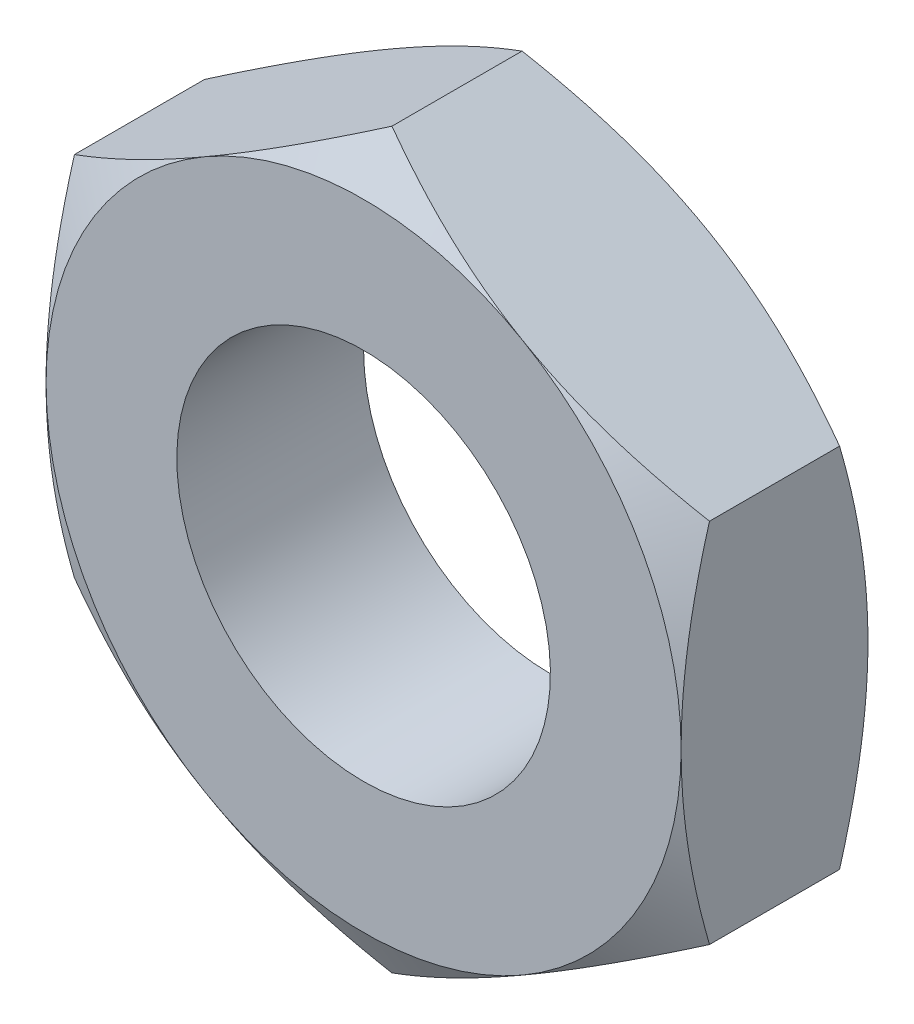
ISO-10303-21;
HEADER;
FILE_DESCRIPTION(('STEP AP214'),'2;1');
FILE_NAME('part.step','',(''),(''),'','','');
FILE_SCHEMA(('AUTOMOTIVE_DESIGN { 1 0 10303 214 1 1 1 1 }'));
ENDSEC;
DATA;
#1=APPLICATION_CONTEXT('core data for automotive mechanical design processes');
#2=APPLICATION_PROTOCOL_DEFINITION('international standard','automotive_design',2000,#1);
#3=PRODUCT_CONTEXT('',#1,'mechanical');
#4=PRODUCT('Part','Part','',(#3));
#5=PRODUCT_RELATED_PRODUCT_CATEGORY('part','',(#4));
#6=PRODUCT_DEFINITION_FORMATION('','',#4);
#7=PRODUCT_DEFINITION_CONTEXT('part definition',#1,'design');
#8=PRODUCT_DEFINITION('design','',#6,#7);
#9=PRODUCT_DEFINITION_SHAPE('','',#8);
#10=(LENGTH_UNIT() NAMED_UNIT(*) SI_UNIT(.MILLI.,.METRE.));
#11=(NAMED_UNIT(*) PLANE_ANGLE_UNIT() SI_UNIT($,.RADIAN.));
#12=(NAMED_UNIT(*) SI_UNIT($,.STERADIAN.) SOLID_ANGLE_UNIT());
#13=UNCERTAINTY_MEASURE_WITH_UNIT(LENGTH_MEASURE(1.E-05),#10,'distance_accuracy_value','');
#14=(GEOMETRIC_REPRESENTATION_CONTEXT(3) GLOBAL_UNCERTAINTY_ASSIGNED_CONTEXT((#13)) GLOBAL_UNIT_ASSIGNED_CONTEXT((#10,
#11,#12)) REPRESENTATION_CONTEXT('',''));
#15=CARTESIAN_POINT('',(0.,0.,0.));
#16=DIRECTION('',(0.,0.,1.));
#17=DIRECTION('',(1.,0.,0.));
#18=AXIS2_PLACEMENT_3D('',#15,#16,#17);
#19=CARTESIAN_POINT('',(5.,0.,0.));
#20=DIRECTION('',(0.,0.,-1.));
#21=DIRECTION('',(0.,1.,0.));
#22=AXIS2_PLACEMENT_3D('',#19,#20,#21);
#23=PLANE('',#22);
#24=CARTESIAN_POINT('',(0.,0.,0.));
#25=DIRECTION('',(0.,0.,-1.));
#26=DIRECTION('',(0.,1.,0.));
#27=AXIS2_PLACEMENT_3D('',#24,#25,#26);
#28=CIRCLE('',#27,5.);
#29=CARTESIAN_POINT('',(0.,5.,0.));
#30=VERTEX_POINT('',#29);
#31=EDGE_CURVE('E109',#30,#30,#28,.T.);
#32=ORIENTED_EDGE('',*,*,#31,.F.);
#33=EDGE_LOOP('',(#32));
#34=FACE_BOUND('',#33,.T.);
#35=CARTESIAN_POINT('',(0.,0.,0.));
#36=DIRECTION('',(0.,0.,1.));
#37=DIRECTION('',(0.,-1.,0.));
#38=AXIS2_PLACEMENT_3D('',#35,#36,#37);
#39=CIRCLE('',#38,8.5);
#40=CARTESIAN_POINT('',(-4.25,7.36121593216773,0.));
#41=VERTEX_POINT('',#40);
#42=CARTESIAN_POINT('',(-8.5,0.,0.));
#43=VERTEX_POINT('',#42);
#44=EDGE_CURVE('E415',#41,#43,#39,.T.);
#45=ORIENTED_EDGE('',*,*,#44,.F.);
#46=CARTESIAN_POINT('',(0.,0.,0.));
#47=DIRECTION('',(0.,0.,1.));
#48=DIRECTION('',(0.,-1.,0.));
#49=AXIS2_PLACEMENT_3D('',#46,#47,#48);
#50=CIRCLE('',#49,8.5);
#51=CARTESIAN_POINT('',(4.25,7.36121593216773,0.));
#52=VERTEX_POINT('',#51);
#53=EDGE_CURVE('E104',#52,#41,#50,.T.);
#54=ORIENTED_EDGE('',*,*,#53,.F.);
#55=CARTESIAN_POINT('',(0.,0.,0.));
#56=DIRECTION('',(0.,0.,1.));
#57=DIRECTION('',(0.,-1.,0.));
#58=AXIS2_PLACEMENT_3D('',#55,#56,#57);
#59=CIRCLE('',#58,8.5);
#60=CARTESIAN_POINT('',(8.5,0.,0.));
#61=VERTEX_POINT('',#60);
#62=EDGE_CURVE('E17',#61,#52,#59,.T.);
#63=ORIENTED_EDGE('',*,*,#62,.F.);
#64=CARTESIAN_POINT('',(0.,0.,0.));
#65=DIRECTION('',(0.,0.,1.));
#66=DIRECTION('',(0.,-1.,0.));
#67=AXIS2_PLACEMENT_3D('',#64,#65,#66);
#68=CIRCLE('',#67,8.5);
#69=CARTESIAN_POINT('',(4.25,-7.36121593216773,0.));
#70=VERTEX_POINT('',#69);
#71=EDGE_CURVE('E101',#70,#61,#68,.T.);
#72=ORIENTED_EDGE('',*,*,#71,.F.);
#73=CARTESIAN_POINT('',(0.,0.,0.));
#74=DIRECTION('',(0.,0.,1.));
#75=DIRECTION('',(0.,-1.,0.));
#76=AXIS2_PLACEMENT_3D('',#73,#74,#75);
#77=CIRCLE('',#76,8.5);
#78=CARTESIAN_POINT('',(-4.25,-7.36121593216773,0.));
#79=VERTEX_POINT('',#78);
#80=EDGE_CURVE('E119',#79,#70,#77,.T.);
#81=ORIENTED_EDGE('',*,*,#80,.F.);
#82=CARTESIAN_POINT('',(0.,0.,0.));
#83=DIRECTION('',(0.,0.,1.));
#84=DIRECTION('',(0.,-1.,0.));
#85=AXIS2_PLACEMENT_3D('',#82,#83,#84);
#86=CIRCLE('',#85,8.5);
#87=EDGE_CURVE('E417',#43,#79,#86,.T.);
#88=ORIENTED_EDGE('',*,*,#87,.F.);
#89=EDGE_LOOP('',(#45,#54,#63,#72,#81,#88));
#90=FACE_BOUND('',#89,.T.);
#91=ADVANCED_FACE('F14',(#34,#90),#23,.T.);
#92=CARTESIAN_POINT('',(0.,0.,0.763744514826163));
#93=DIRECTION('',(0.,0.,1.));
#94=DIRECTION('',(0.,-1.,0.));
#95=AXIS2_PLACEMENT_3D('',#92,#93,#94);
#96=CONICAL_SURFACE('',#95,9.82284430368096,1.0471975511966);
#97=CARTESIAN_POINT('',(8.5,4.90747728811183,0.759189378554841));
#98=CARTESIAN_POINT('',(8.15405181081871,5.1072105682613,0.643844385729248));
#99=CARTESIAN_POINT('',(7.8053331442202,5.3085433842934,0.538168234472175));
#100=CARTESIAN_POINT('',(7.10482189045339,5.71298374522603,0.351810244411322));
#101=CARTESIAN_POINT('',(6.75305373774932,5.91607718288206,0.27100481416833));
#102=CARTESIAN_POINT('',(6.22208167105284,6.22263404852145,0.171789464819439));
#103=CARTESIAN_POINT('',(6.04442025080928,6.32520691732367,0.142371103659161));
#104=CARTESIAN_POINT('',(5.6882468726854,6.53084371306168,0.0914473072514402));
#105=CARTESIAN_POINT('',(5.50973493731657,6.63390762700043,0.0699416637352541));
#106=CARTESIAN_POINT('',(5.15120023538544,6.84090773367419,0.0352211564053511));
#107=CARTESIAN_POINT('',(4.97117438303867,6.94484570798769,0.0220484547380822));
#108=CARTESIAN_POINT('',(4.61076862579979,7.15292606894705,0.00441964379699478));
#109=CARTESIAN_POINT('',(4.43038865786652,7.25706849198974,-3.47391832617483E-05));
#110=CARTESIAN_POINT('',(4.25,7.36121593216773,0.));
#111=B_SPLINE_CURVE_WITH_KNOTS('',3,(#97,#98,#99,#100,#101,#102,#103,#104,#105,#106,#107,#108,
#109,#110),.UNSPECIFIED.,.F.,.F.,(4,2,2,2,2,2,4),(0.,1.24786231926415,2.48941953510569,
3.1110127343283,3.73258957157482,4.35728675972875,4.98210763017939),.UNSPECIFIED.);
#112=CARTESIAN_POINT('',(8.5,4.90747728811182,0.759189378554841));
#113=VERTEX_POINT('',#112);
#114=EDGE_CURVE('E124',#113,#52,#111,.T.);
#115=ORIENTED_EDGE('',*,*,#114,.F.);
#116=CARTESIAN_POINT('',(8.5,0.,0.));
#117=CARTESIAN_POINT('',(8.5,0.208294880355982,-3.47391832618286E-05));
#118=CARTESIAN_POINT('',(8.5,0.416579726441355,0.00441964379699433));
#119=CARTESIAN_POINT('',(8.5,0.832740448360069,0.0220484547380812));
#120=CARTESIAN_POINT('',(8.5,1.04061639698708,0.0352211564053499));
#121=CARTESIAN_POINT('',(8.5,1.45461661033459,0.0699416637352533));
#122=CARTESIAN_POINT('',(8.5,1.6607444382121,0.0914473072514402));
#123=CARTESIAN_POINT('',(8.5,2.07201802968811,0.142371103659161));
#124=CARTESIAN_POINT('',(8.5,2.27716376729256,0.171789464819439));
#125=CARTESIAN_POINT('',(8.5,2.89027749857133,0.271004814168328));
#126=CARTESIAN_POINT('',(8.5,3.29646437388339,0.35181024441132));
#127=CARTESIAN_POINT('',(8.5,4.10534509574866,0.538168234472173));
#128=CARTESIAN_POINT('',(8.5,4.50801072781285,0.643844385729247));
#129=CARTESIAN_POINT('',(8.5,4.90747728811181,0.759189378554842));
#130=B_SPLINE_CURVE_WITH_KNOTS('',3,(#116,#117,#118,#119,#120,#121,#122,#123,#124,#125,#126,
#127,#128,#129),.UNSPECIFIED.,.F.,.F.,(4,2,2,2,2,2,4),(0.,0.624820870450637,1.24951805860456,
1.87109489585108,2.49268809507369,3.73424531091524,4.98210763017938),.UNSPECIFIED.);
#131=EDGE_CURVE('E121',#61,#113,#130,.T.);
#132=ORIENTED_EDGE('',*,*,#131,.F.);
#133=ORIENTED_EDGE('',*,*,#62,.T.);
#134=EDGE_LOOP('',(#115,#132,#133));
#135=FACE_BOUND('',#134,.T.);
#136=ADVANCED_FACE('F122',(#135),#96,.T.);
#137=CARTESIAN_POINT('',(0.,0.,0.763744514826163));
#138=DIRECTION('',(0.,0.,1.));
#139=DIRECTION('',(0.,-1.,0.));
#140=AXIS2_PLACEMENT_3D('',#137,#138,#139);
#141=CONICAL_SURFACE('',#140,9.82284430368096,1.0471975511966);
#142=CARTESIAN_POINT('',(0.,9.81495457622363,0.759189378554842));
#143=CARTESIAN_POINT('',(-0.3459481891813,9.61522129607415,0.643844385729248));
#144=CARTESIAN_POINT('',(-0.694666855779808,9.41388848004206,0.538168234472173));
#145=CARTESIAN_POINT('',(-1.39517810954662,9.00944811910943,0.351810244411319));
#146=CARTESIAN_POINT('',(-1.74694626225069,8.80635468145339,0.271004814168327));
#147=CARTESIAN_POINT('',(-2.27791832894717,8.49979781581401,0.171789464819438));
#148=CARTESIAN_POINT('',(-2.45557974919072,8.39722494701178,0.142371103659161));
#149=CARTESIAN_POINT('',(-2.8117531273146,8.19158815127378,0.0914473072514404));
#150=CARTESIAN_POINT('',(-2.99026506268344,8.08852423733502,0.0699416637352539));
#151=CARTESIAN_POINT('',(-3.34879976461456,7.88152413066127,0.0352211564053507));
#152=CARTESIAN_POINT('',(-3.52882561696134,7.77758615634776,0.0220484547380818));
#153=CARTESIAN_POINT('',(-3.88923137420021,7.56950579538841,0.00441964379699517));
#154=CARTESIAN_POINT('',(-4.06961134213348,7.46536337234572,-3.4739183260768E-05));
#155=CARTESIAN_POINT('',(-4.25,7.36121593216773,0.));
#156=B_SPLINE_CURVE_WITH_KNOTS('',3,(#142,#143,#144,#145,#146,#147,#148,#149,#150,#151,#152,
#153,#154,#155),.UNSPECIFIED.,.F.,.F.,(4,2,2,2,2,2,4),(0.,1.24786231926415,2.48941953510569,
3.11101273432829,3.73258957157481,4.35728675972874,4.98210763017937),.UNSPECIFIED.);
#157=CARTESIAN_POINT('',(0.,9.81495457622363,0.759189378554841));
#158=VERTEX_POINT('',#157);
#159=EDGE_CURVE('E294',#158,#41,#156,.T.);
#160=ORIENTED_EDGE('',*,*,#159,.F.);
#161=CARTESIAN_POINT('',(4.25,7.36121593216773,0.));
#162=CARTESIAN_POINT('',(4.06961134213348,7.46536337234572,-3.47391832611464E-05));
#163=CARTESIAN_POINT('',(3.88923137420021,7.56950579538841,0.00441964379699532));
#164=CARTESIAN_POINT('',(3.52882561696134,7.77758615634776,0.0220484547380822));
#165=CARTESIAN_POINT('',(3.34879976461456,7.88152413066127,0.0352211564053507));
#166=CARTESIAN_POINT('',(2.99026506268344,8.08852423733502,0.0699416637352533));
#167=CARTESIAN_POINT('',(2.8117531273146,8.19158815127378,0.0914473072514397));
#168=CARTESIAN_POINT('',(2.45557974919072,8.39722494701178,0.14237110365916));
#169=CARTESIAN_POINT('',(2.27791832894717,8.49979781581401,0.171789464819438));
#170=CARTESIAN_POINT('',(1.74694626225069,8.80635468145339,0.271004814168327));
#171=CARTESIAN_POINT('',(1.39517810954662,9.00944811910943,0.351810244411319));
#172=CARTESIAN_POINT('',(0.694666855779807,9.41388848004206,0.538168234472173));
#173=CARTESIAN_POINT('',(0.345948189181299,9.61522129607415,0.643844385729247));
#174=CARTESIAN_POINT('',(0.,9.81495457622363,0.759189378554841));
#175=B_SPLINE_CURVE_WITH_KNOTS('',3,(#161,#162,#163,#164,#165,#166,#167,#168,#169,#170,#171,
#172,#173,#174),.UNSPECIFIED.,.F.,.F.,(4,2,2,2,2,2,4),(0.,0.624820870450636,1.24951805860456,
1.87109489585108,2.49268809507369,3.73424531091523,4.98210763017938),.UNSPECIFIED.);
#176=EDGE_CURVE('E302',#52,#158,#175,.T.);
#177=ORIENTED_EDGE('',*,*,#176,.F.);
#178=ORIENTED_EDGE('',*,*,#53,.T.);
#179=EDGE_LOOP('',(#160,#177,#178));
#180=FACE_BOUND('',#179,.T.);
#181=ADVANCED_FACE('F283',(#180),#141,.T.);
#182=CARTESIAN_POINT('',(0.,0.,0.763744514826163));
#183=DIRECTION('',(0.,0.,1.));
#184=DIRECTION('',(0.,-1.,0.));
#185=AXIS2_PLACEMENT_3D('',#182,#183,#184);
#186=CONICAL_SURFACE('',#185,9.82284430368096,1.0471975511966);
#187=CARTESIAN_POINT('',(-8.5,4.90747728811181,0.759189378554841));
#188=CARTESIAN_POINT('',(-8.5,4.50801072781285,0.643844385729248));
#189=CARTESIAN_POINT('',(-8.5,4.10534509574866,0.538168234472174));
#190=CARTESIAN_POINT('',(-8.5,3.29646437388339,0.35181024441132));
#191=CARTESIAN_POINT('',(-8.5,2.89027749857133,0.271004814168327));
#192=CARTESIAN_POINT('',(-8.5,2.27716376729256,0.171789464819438));
#193=CARTESIAN_POINT('',(-8.5,2.07201802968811,0.142371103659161));
#194=CARTESIAN_POINT('',(-8.5,1.66074443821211,0.0914473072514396));
#195=CARTESIAN_POINT('',(-8.5,1.45461661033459,0.0699416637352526));
#196=CARTESIAN_POINT('',(-8.5,1.04061639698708,0.0352211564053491));
#197=CARTESIAN_POINT('',(-8.5,0.832740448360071,0.0220484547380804));
#198=CARTESIAN_POINT('',(-8.5,0.416579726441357,0.00441964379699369));
#199=CARTESIAN_POINT('',(-8.5,0.208294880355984,-3.4739183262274E-05));
#200=CARTESIAN_POINT('',(-8.5,0.,0.));
#201=B_SPLINE_CURVE_WITH_KNOTS('',3,(#187,#188,#189,#190,#191,#192,#193,#194,#195,#196,#197,
#198,#199,#200),.UNSPECIFIED.,.F.,.F.,(4,2,2,2,2,2,4),(0.,1.24786231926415,2.48941953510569,
3.1110127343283,3.73258957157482,4.35728675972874,4.98210763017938),.UNSPECIFIED.);
#202=CARTESIAN_POINT('',(-8.5,4.90747728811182,0.759189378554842));
#203=VERTEX_POINT('',#202);
#204=EDGE_CURVE('E262',#203,#43,#201,.T.);
#205=ORIENTED_EDGE('',*,*,#204,.F.);
#206=CARTESIAN_POINT('',(-4.25,7.36121593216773,0.));
#207=CARTESIAN_POINT('',(-4.43038865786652,7.25706849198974,-3.47391832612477E-05));
#208=CARTESIAN_POINT('',(-4.61076862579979,7.15292606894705,0.00441964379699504));
#209=CARTESIAN_POINT('',(-4.97117438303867,6.94484570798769,0.0220484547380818));
#210=CARTESIAN_POINT('',(-5.15120023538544,6.84090773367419,0.0352211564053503));
#211=CARTESIAN_POINT('',(-5.50973493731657,6.63390762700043,0.0699416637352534));
#212=CARTESIAN_POINT('',(-5.6882468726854,6.53084371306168,0.0914473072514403));
#213=CARTESIAN_POINT('',(-6.04442025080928,6.32520691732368,0.142371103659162));
#214=CARTESIAN_POINT('',(-6.22208167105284,6.22263404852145,0.171789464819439));
#215=CARTESIAN_POINT('',(-6.75305373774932,5.91607718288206,0.271004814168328));
#216=CARTESIAN_POINT('',(-7.10482189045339,5.71298374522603,0.351810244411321));
#217=CARTESIAN_POINT('',(-7.8053331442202,5.3085433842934,0.538168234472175));
#218=CARTESIAN_POINT('',(-8.15405181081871,5.10721056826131,0.64384438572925));
#219=CARTESIAN_POINT('',(-8.5,4.90747728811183,0.759189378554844));
#220=B_SPLINE_CURVE_WITH_KNOTS('',3,(#206,#207,#208,#209,#210,#211,#212,#213,#214,#215,#216,
#217,#218,#219),.UNSPECIFIED.,.F.,.F.,(4,2,2,2,2,2,4),(0.,0.624820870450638,1.24951805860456,
1.87109489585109,2.49268809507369,3.73424531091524,4.98210763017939),.UNSPECIFIED.);
#221=EDGE_CURVE('E287',#41,#203,#220,.T.);
#222=ORIENTED_EDGE('',*,*,#221,.F.);
#223=ORIENTED_EDGE('',*,*,#44,.T.);
#224=EDGE_LOOP('',(#205,#222,#223));
#225=FACE_BOUND('',#224,.T.);
#226=ADVANCED_FACE('F277',(#225),#186,.T.);
#227=CARTESIAN_POINT('',(0.,0.,0.763744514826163));
#228=DIRECTION('',(0.,0.,1.));
#229=DIRECTION('',(0.,-1.,0.));
#230=AXIS2_PLACEMENT_3D('',#227,#228,#229);
#231=CONICAL_SURFACE('',#230,9.82284430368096,1.0471975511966);
#232=CARTESIAN_POINT('',(-8.5,0.,0.));
#233=CARTESIAN_POINT('',(-8.5,-0.208294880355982,-3.47391832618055E-05));
#234=CARTESIAN_POINT('',(-8.5,-0.416579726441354,0.00441964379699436));
#235=CARTESIAN_POINT('',(-8.5,-0.832740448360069,0.0220484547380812));
#236=CARTESIAN_POINT('',(-8.5,-1.04061639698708,0.0352211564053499));
#237=CARTESIAN_POINT('',(-8.5,-1.45461661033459,0.0699416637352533));
#238=CARTESIAN_POINT('',(-8.5,-1.6607444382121,0.0914473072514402));
#239=CARTESIAN_POINT('',(-8.5,-2.07201802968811,0.142371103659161));
#240=CARTESIAN_POINT('',(-8.5,-2.27716376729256,0.171789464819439));
#241=CARTESIAN_POINT('',(-8.5,-2.89027749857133,0.271004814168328));
#242=CARTESIAN_POINT('',(-8.5,-3.29646437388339,0.35181024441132));
#243=CARTESIAN_POINT('',(-8.5,-4.10534509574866,0.538168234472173));
#244=CARTESIAN_POINT('',(-8.5,-4.50801072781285,0.643844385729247));
#245=CARTESIAN_POINT('',(-8.5,-4.90747728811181,0.759189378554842));
#246=B_SPLINE_CURVE_WITH_KNOTS('',3,(#232,#233,#234,#235,#236,#237,#238,#239,#240,#241,#242,
#243,#244,#245),.UNSPECIFIED.,.F.,.F.,(4,2,2,2,2,2,4),(0.,0.624820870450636,1.24951805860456,
1.87109489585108,2.49268809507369,3.73424531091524,4.98210763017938),.UNSPECIFIED.);
#247=CARTESIAN_POINT('',(-8.5,-4.90747728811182,0.759189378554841));
#248=VERTEX_POINT('',#247);
#249=EDGE_CURVE('E255',#43,#248,#246,.T.);
#250=ORIENTED_EDGE('',*,*,#249,.F.);
#251=ORIENTED_EDGE('',*,*,#87,.T.);
#252=CARTESIAN_POINT('',(-8.5,-4.90747728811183,0.759189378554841));
#253=CARTESIAN_POINT('',(-8.15405181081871,-5.1072105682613,0.643844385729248));
#254=CARTESIAN_POINT('',(-7.8053331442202,-5.3085433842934,0.538168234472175));
#255=CARTESIAN_POINT('',(-7.10482189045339,-5.71298374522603,0.351810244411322));
#256=CARTESIAN_POINT('',(-6.75305373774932,-5.91607718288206,0.27100481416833));
#257=CARTESIAN_POINT('',(-6.22208167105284,-6.22263404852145,0.171789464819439));
#258=CARTESIAN_POINT('',(-6.04442025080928,-6.32520691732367,0.142371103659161));
#259=CARTESIAN_POINT('',(-5.6882468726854,-6.53084371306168,0.0914473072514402));
#260=CARTESIAN_POINT('',(-5.50973493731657,-6.63390762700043,0.0699416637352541));
#261=CARTESIAN_POINT('',(-5.15120023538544,-6.84090773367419,0.0352211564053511));
#262=CARTESIAN_POINT('',(-4.97117438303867,-6.94484570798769,0.0220484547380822));
#263=CARTESIAN_POINT('',(-4.61076862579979,-7.15292606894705,0.00441964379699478));
#264=CARTESIAN_POINT('',(-4.43038865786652,-7.25706849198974,-3.47391832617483E-05));
#265=CARTESIAN_POINT('',(-4.25,-7.36121593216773,0.));
#266=B_SPLINE_CURVE_WITH_KNOTS('',3,(#252,#253,#254,#255,#256,#257,#258,#259,#260,#261,#262,
#263,#264,#265),.UNSPECIFIED.,.F.,.F.,(4,2,2,2,2,2,4),(0.,1.24786231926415,2.48941953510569,
3.1110127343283,3.73258957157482,4.35728675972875,4.98210763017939),.UNSPECIFIED.);
#267=EDGE_CURVE('E263',#248,#79,#266,.T.);
#268=ORIENTED_EDGE('',*,*,#267,.F.);
#269=EDGE_LOOP('',(#250,#251,#268));
#270=FACE_BOUND('',#269,.T.);
#271=ADVANCED_FACE('F274',(#270),#231,.T.);
#272=CARTESIAN_POINT('',(0.,0.,0.763744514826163));
#273=DIRECTION('',(0.,0.,1.));
#274=DIRECTION('',(0.,-1.,0.));
#275=AXIS2_PLACEMENT_3D('',#272,#273,#274);
#276=CONICAL_SURFACE('',#275,9.82284430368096,1.0471975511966);
#277=CARTESIAN_POINT('',(0.,-9.81495457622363,0.759189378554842));
#278=CARTESIAN_POINT('',(0.3459481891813,-9.61522129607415,0.643844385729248));
#279=CARTESIAN_POINT('',(0.694666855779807,-9.41388848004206,0.538168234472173));
#280=CARTESIAN_POINT('',(1.39517810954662,-9.00944811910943,0.351810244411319));
#281=CARTESIAN_POINT('',(1.74694626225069,-8.80635468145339,0.271004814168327));
#282=CARTESIAN_POINT('',(2.27791832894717,-8.49979781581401,0.171789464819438));
#283=CARTESIAN_POINT('',(2.45557974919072,-8.39722494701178,0.142371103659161));
#284=CARTESIAN_POINT('',(2.8117531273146,-8.19158815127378,0.0914473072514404));
#285=CARTESIAN_POINT('',(2.99026506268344,-8.08852423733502,0.0699416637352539));
#286=CARTESIAN_POINT('',(3.34879976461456,-7.88152413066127,0.0352211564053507));
#287=CARTESIAN_POINT('',(3.52882561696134,-7.77758615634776,0.0220484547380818));
#288=CARTESIAN_POINT('',(3.88923137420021,-7.56950579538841,0.00441964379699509));
#289=CARTESIAN_POINT('',(4.06961134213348,-7.46536337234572,-3.47391832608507E-05));
#290=CARTESIAN_POINT('',(4.25,-7.36121593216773,0.));
#291=B_SPLINE_CURVE_WITH_KNOTS('',3,(#277,#278,#279,#280,#281,#282,#283,#284,#285,#286,#287,
#288,#289,#290),.UNSPECIFIED.,.F.,.F.,(4,2,2,2,2,2,4),(0.,1.24786231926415,2.48941953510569,
3.11101273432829,3.73258957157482,4.35728675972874,4.98210763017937),.UNSPECIFIED.);
#292=CARTESIAN_POINT('',(0.,-9.81495457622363,0.759189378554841));
#293=VERTEX_POINT('',#292);
#294=EDGE_CURVE('E163',#293,#70,#291,.T.);
#295=ORIENTED_EDGE('',*,*,#294,.F.);
#296=CARTESIAN_POINT('',(-4.25,-7.36121593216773,0.));
#297=CARTESIAN_POINT('',(-4.06961134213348,-7.46536337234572,-3.47391832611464E-05));
#298=CARTESIAN_POINT('',(-3.88923137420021,-7.56950579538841,0.00441964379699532));
#299=CARTESIAN_POINT('',(-3.52882561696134,-7.77758615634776,0.0220484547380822));
#300=CARTESIAN_POINT('',(-3.34879976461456,-7.88152413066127,0.0352211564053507));
#301=CARTESIAN_POINT('',(-2.99026506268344,-8.08852423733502,0.0699416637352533));
#302=CARTESIAN_POINT('',(-2.8117531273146,-8.19158815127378,0.0914473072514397));
#303=CARTESIAN_POINT('',(-2.45557974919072,-8.39722494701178,0.14237110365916));
#304=CARTESIAN_POINT('',(-2.27791832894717,-8.49979781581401,0.171789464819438));
#305=CARTESIAN_POINT('',(-1.74694626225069,-8.80635468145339,0.271004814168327));
#306=CARTESIAN_POINT('',(-1.39517810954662,-9.00944811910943,0.351810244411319));
#307=CARTESIAN_POINT('',(-0.694666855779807,-9.41388848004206,0.538168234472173));
#308=CARTESIAN_POINT('',(-0.345948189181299,-9.61522129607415,0.643844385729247));
#309=CARTESIAN_POINT('',(0.,-9.81495457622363,0.759189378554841));
#310=B_SPLINE_CURVE_WITH_KNOTS('',3,(#296,#297,#298,#299,#300,#301,#302,#303,#304,#305,#306,
#307,#308,#309),.UNSPECIFIED.,.F.,.F.,(4,2,2,2,2,2,4),(0.,0.624820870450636,1.24951805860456,
1.87109489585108,2.49268809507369,3.73424531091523,4.98210763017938),.UNSPECIFIED.);
#311=EDGE_CURVE('E368',#79,#293,#310,.T.);
#312=ORIENTED_EDGE('',*,*,#311,.F.);
#313=ORIENTED_EDGE('',*,*,#80,.T.);
#314=EDGE_LOOP('',(#295,#312,#313));
#315=FACE_BOUND('',#314,.T.);
#316=ADVANCED_FACE('F150',(#315),#276,.T.);
#317=CARTESIAN_POINT('',(0.,0.,0.763744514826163));
#318=DIRECTION('',(0.,0.,1.));
#319=DIRECTION('',(0.,-1.,0.));
#320=AXIS2_PLACEMENT_3D('',#317,#318,#319);
#321=CONICAL_SURFACE('',#320,9.82284430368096,1.0471975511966);
#322=CARTESIAN_POINT('',(8.5,-4.90747728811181,0.759189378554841));
#323=CARTESIAN_POINT('',(8.5,-4.50801072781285,0.643844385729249));
#324=CARTESIAN_POINT('',(8.5,-4.10534509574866,0.538168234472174));
#325=CARTESIAN_POINT('',(8.5,-3.29646437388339,0.35181024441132));
#326=CARTESIAN_POINT('',(8.5,-2.89027749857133,0.271004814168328));
#327=CARTESIAN_POINT('',(8.5,-2.27716376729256,0.171789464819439));
#328=CARTESIAN_POINT('',(8.5,-2.07201802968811,0.142371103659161));
#329=CARTESIAN_POINT('',(8.5,-1.6607444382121,0.0914473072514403));
#330=CARTESIAN_POINT('',(8.5,-1.45461661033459,0.0699416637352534));
#331=CARTESIAN_POINT('',(8.5,-1.04061639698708,0.03522115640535));
#332=CARTESIAN_POINT('',(8.5,-0.83274044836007,0.0220484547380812));
#333=CARTESIAN_POINT('',(8.5,-0.416579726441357,0.0044196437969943));
#334=CARTESIAN_POINT('',(8.5,-0.208294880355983,-3.47391832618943E-05));
#335=CARTESIAN_POINT('',(8.5,0.,0.));
#336=B_SPLINE_CURVE_WITH_KNOTS('',3,(#322,#323,#324,#325,#326,#327,#328,#329,#330,#331,#332,
#333,#334,#335),.UNSPECIFIED.,.F.,.F.,(4,2,2,2,2,2,4),(0.,1.24786231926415,2.48941953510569,
3.1110127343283,3.73258957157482,4.35728675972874,4.98210763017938),.UNSPECIFIED.);
#337=CARTESIAN_POINT('',(8.5,-4.90747728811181,0.759189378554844));
#338=VERTEX_POINT('',#337);
#339=EDGE_CURVE('E114',#338,#61,#336,.T.);
#340=ORIENTED_EDGE('',*,*,#339,.F.);
#341=CARTESIAN_POINT('',(4.25,-7.36121593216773,0.));
#342=CARTESIAN_POINT('',(4.43038865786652,-7.25706849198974,-3.47391832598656E-05));
#343=CARTESIAN_POINT('',(4.61076862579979,-7.15292606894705,0.00441964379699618));
#344=CARTESIAN_POINT('',(4.97117438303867,-6.94484570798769,0.0220484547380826));
#345=CARTESIAN_POINT('',(5.15120023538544,-6.84090773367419,0.035221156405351));
#346=CARTESIAN_POINT('',(5.50973493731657,-6.63390762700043,0.0699416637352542));
#347=CARTESIAN_POINT('',(5.6882468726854,-6.53084371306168,0.0914473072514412));
#348=CARTESIAN_POINT('',(6.04442025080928,-6.32520691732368,0.142371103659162));
#349=CARTESIAN_POINT('',(6.22208167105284,-6.22263404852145,0.171789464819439));
#350=CARTESIAN_POINT('',(6.75305373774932,-5.91607718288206,0.271004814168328));
#351=CARTESIAN_POINT('',(7.10482189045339,-5.71298374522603,0.351810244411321));
#352=CARTESIAN_POINT('',(7.8053331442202,-5.3085433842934,0.538168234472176));
#353=CARTESIAN_POINT('',(8.15405181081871,-5.10721056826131,0.64384438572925));
#354=CARTESIAN_POINT('',(8.5,-4.90747728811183,0.759189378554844));
#355=B_SPLINE_CURVE_WITH_KNOTS('',3,(#341,#342,#343,#344,#345,#346,#347,#348,#349,#350,#351,
#352,#353,#354),.UNSPECIFIED.,.F.,.F.,(4,2,2,2,2,2,4),(0.,0.624820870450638,1.24951805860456,
1.87109489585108,2.49268809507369,3.73424531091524,4.98210763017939),.UNSPECIFIED.);
#356=EDGE_CURVE('E117',#70,#338,#355,.T.);
#357=ORIENTED_EDGE('',*,*,#356,.F.);
#358=ORIENTED_EDGE('',*,*,#71,.T.);
#359=EDGE_LOOP('',(#340,#357,#358));
#360=FACE_BOUND('',#359,.T.);
#361=ADVANCED_FACE('F112',(#360),#321,.T.);
#362=CARTESIAN_POINT('',(8.5,-4.90747728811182,0.));
#363=DIRECTION('',(1.,0.,0.));
#364=DIRECTION('',(0.,1.,0.));
#365=AXIS2_PLACEMENT_3D('',#362,#363,#364);
#366=PLANE('',#365);
#367=ORIENTED_EDGE('',*,*,#339,.T.);
#368=ORIENTED_EDGE('',*,*,#131,.T.);
#369=DIRECTION('',(0.,0.,1.));
#370=VECTOR('',#369,1.);
#371=CARTESIAN_POINT('',(8.5,4.90747728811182,0.));
#372=LINE('',#371,#370);
#373=CARTESIAN_POINT('',(8.50000001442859,4.90747727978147,4.24081061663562));
#374=VERTEX_POINT('',#373);
#375=EDGE_CURVE('E127',#374,#113,#372,.F.);
#376=ORIENTED_EDGE('',*,*,#375,.F.);
#377=CARTESIAN_POINT('',(8.5,0.,5.));
#378=CARTESIAN_POINT('',(8.5,0.208294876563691,5.00003473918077));
#379=CARTESIAN_POINT('',(8.5,0.41657971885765,4.9955803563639));
#380=CARTESIAN_POINT('',(8.5,0.83274043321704,4.9779515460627));
#381=CARTESIAN_POINT('',(8.5,1.04061637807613,4.96477884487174));
#382=CARTESIAN_POINT('',(8.5,1.4546165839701,4.93005833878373));
#383=CARTESIAN_POINT('',(8.5,1.66074440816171,4.9085526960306));
#384=CARTESIAN_POINT('',(8.5,2.07201799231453,4.85762890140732));
#385=CARTESIAN_POINT('',(8.5,2.27716372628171,4.82821054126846));
#386=CARTESIAN_POINT('',(8.5,2.89027744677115,4.72899519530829));
#387=CARTESIAN_POINT('',(8.5,3.29646431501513,4.64818976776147));
#388=CARTESIAN_POINT('',(8.5,4.10534502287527,4.4618317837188));
#389=CARTESIAN_POINT('',(8.5,4.50801064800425,4.35615563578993));
#390=CARTESIAN_POINT('',(8.5,4.90747720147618,4.2408106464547));
#391=B_SPLINE_CURVE_WITH_KNOTS('',3,(#377,#378,#379,#380,#381,#382,#383,#384,#385,#386,#387,
#388,#389,#390),.UNSPECIFIED.,.F.,.F.,(4,2,2,2,2,2,4),(0.,0.624820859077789,1.24951803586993,
1.87109486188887,2.49268804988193,3.73424524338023,4.98210754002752),.UNSPECIFIED.);
#392=CARTESIAN_POINT('',(8.5,0.,5.));
#393=VERTEX_POINT('',#392);
#394=EDGE_CURVE('E348',#393,#374,#391,.T.);
#395=ORIENTED_EDGE('',*,*,#394,.F.);
#396=CARTESIAN_POINT('',(8.49999996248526,-4.90747731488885,4.24081058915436));
#397=CARTESIAN_POINT('',(8.49999998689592,-4.5080107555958,4.35615559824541));
#398=CARTESIAN_POINT('',(8.49999999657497,-4.10534512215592,4.46183175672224));
#399=CARTESIAN_POINT('',(8.50000000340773,-3.29646439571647,4.64818975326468));
#400=CARTESIAN_POINT('',(8.50000000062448,-2.89027751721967,4.72899518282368));
#401=CARTESIAN_POINT('',(8.49999999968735,-2.27716378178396,4.82821053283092));
#402=CARTESIAN_POINT('',(8.49999999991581,-2.07201804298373,4.85762889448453));
#403=CARTESIAN_POINT('',(8.50000000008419,-1.66074444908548,4.90855269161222));
#404=CARTESIAN_POINT('',(8.50000000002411,-1.45461661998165,4.93005833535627));
#405=CARTESIAN_POINT('',(8.49999999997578,-1.04061640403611,4.96477884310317));
#406=CARTESIAN_POINT('',(8.49999999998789,-0.832740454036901,4.9779515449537));
#407=CARTESIAN_POINT('',(8.50000000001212,-0.416579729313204,4.99558035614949));
#408=CARTESIAN_POINT('',(8.50000000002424,-0.208294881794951,5.00003473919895));
#409=CARTESIAN_POINT('',(8.5,0.,5.));
#410=B_SPLINE_CURVE_WITH_KNOTS('',3,(#396,#397,#398,#399,#400,#401,#402,#403,#404,#405,#406,
#407,#408,#409),.UNSPECIFIED.,.F.,.F.,(4,2,2,2,2,2,4),(0.,1.2478623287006,2.48941955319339,
3.11101275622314,3.73258959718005,4.3572867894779,4.9821076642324),.UNSPECIFIED.);
#411=CARTESIAN_POINT('',(8.5,-4.9074773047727,4.24081061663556));
#412=VERTEX_POINT('',#411);
#413=EDGE_CURVE('E354',#412,#393,#410,.T.);
#414=ORIENTED_EDGE('',*,*,#413,.F.);
#415=DIRECTION('',(0.,0.,1.));
#416=VECTOR('',#415,1.);
#417=CARTESIAN_POINT('',(8.5,-4.90747728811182,0.));
#418=LINE('',#417,#416);
#419=EDGE_CURVE('E131',#338,#412,#418,.T.);
#420=ORIENTED_EDGE('',*,*,#419,.F.);
#421=EDGE_LOOP('',(#367,#368,#376,#395,#414,#420));
#422=FACE_BOUND('',#421,.T.);
#423=ADVANCED_FACE('F129',(#422),#366,.T.);
#424=CARTESIAN_POINT('',(8.5,4.90747728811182,0.));
#425=DIRECTION('',(0.5,0.866025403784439,0.));
#426=DIRECTION('',(-0.866025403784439,0.5,0.));
#427=AXIS2_PLACEMENT_3D('',#424,#425,#426);
#428=PLANE('',#427);
#429=ORIENTED_EDGE('',*,*,#114,.T.);
#430=ORIENTED_EDGE('',*,*,#176,.T.);
#431=DIRECTION('',(0.,0.,1.));
#432=VECTOR('',#431,1.);
#433=CARTESIAN_POINT('',(0.,9.81495457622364,0.));
#434=LINE('',#433,#432);
#435=CARTESIAN_POINT('',(1.44287559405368E-08,9.81495458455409,4.24081061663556));
#436=VERTEX_POINT('',#435);
#437=EDGE_CURVE('E301',#436,#158,#434,.F.);
#438=ORIENTED_EDGE('',*,*,#437,.F.);
#439=CARTESIAN_POINT('',(4.25,7.36121593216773,5.));
#440=CARTESIAN_POINT('',(4.06961134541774,7.46536337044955,5.00003473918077));
#441=CARTESIAN_POINT('',(3.88923138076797,7.56950579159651,4.9955803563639));
#442=CARTESIAN_POINT('',(3.52882563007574,7.77758614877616,4.9779515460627));
#443=CARTESIAN_POINT('',(3.34879978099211,7.88152412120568,4.96477884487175));
#444=CARTESIAN_POINT('',(2.99026508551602,8.08852422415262,4.93005833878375));
#445=CARTESIAN_POINT('',(2.81175315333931,8.19158813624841,4.90855269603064));
#446=CARTESIAN_POINT('',(2.45557978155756,8.39722492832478,4.85762890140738));
#447=CARTESIAN_POINT('',(2.27791836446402,8.49979779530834,4.82821054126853));
#448=CARTESIAN_POINT('',(1.74694630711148,8.806354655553,4.7289951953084));
#449=CARTESIAN_POINT('',(1.39517816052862,9.00944808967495,4.64818976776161));
#450=CARTESIAN_POINT('',(0.694666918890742,9.41388844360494,4.46183178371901));
#451=CARTESIAN_POINT('',(0.345948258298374,9.61522125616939,4.35615563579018));
#452=CARTESIAN_POINT('',(7.50295368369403E-08,9.81495453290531,4.24081064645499));
#453=B_SPLINE_CURVE_WITH_KNOTS('',3,(#439,#440,#441,#442,#443,#444,#445,#446,#447,#448,#449,
#450,#451,#452),.UNSPECIFIED.,.F.,.F.,(4,2,2,2,2,2,4),(0.,0.624820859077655,1.24951803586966,
1.87109486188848,2.4926880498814,3.73424524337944,4.98210754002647),.UNSPECIFIED.);
#454=CARTESIAN_POINT('',(4.25,7.36121593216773,5.));
#455=VERTEX_POINT('',#454);
#456=EDGE_CURVE('E326',#455,#436,#453,.T.);
#457=ORIENTED_EDGE('',*,*,#456,.F.);
#458=CARTESIAN_POINT('',(8.50000000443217,4.90747724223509,4.24081058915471));
#459=CARTESIAN_POINT('',(8.15405182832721,5.10721054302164,4.35615559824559));
#460=CARTESIAN_POINT('',(7.80533316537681,5.30854336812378,4.46183175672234));
#461=CARTESIAN_POINT('',(7.10482191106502,5.71298373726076,4.64818975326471));
#462=CARTESIAN_POINT('',(6.75305375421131,5.91607717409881,4.72899518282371));
#463=CARTESIAN_POINT('',(6.22208168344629,6.22263404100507,4.82821053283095));
#464=CARTESIAN_POINT('',(6.04442026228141,6.32520691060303,4.85762889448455));
#465=CARTESIAN_POINT('',(5.688246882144,6.53084370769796,4.90855269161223));
#466=CARTESIAN_POINT('',(5.50973494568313,6.63390762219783,4.93005833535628));
#467=CARTESIAN_POINT('',(5.1512002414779,6.84090773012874,4.96477884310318));
#468=CARTESIAN_POINT('',(4.97117438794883,6.94484570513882,4.9779515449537));
#469=CARTESIAN_POINT('',(4.61076862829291,7.15292606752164,4.99558035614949));
#470=CARTESIAN_POINT('',(4.43038865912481,7.25706849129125,5.00003473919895));
#471=CARTESIAN_POINT('',(4.25,7.36121593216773,5.));
#472=B_SPLINE_CURVE_WITH_KNOTS('',3,(#458,#459,#460,#461,#462,#463,#464,#465,#466,#467,#468,
#469,#470,#471),.UNSPECIFIED.,.F.,.F.,(4,2,2,2,2,2,4),(0.,1.24786232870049,2.48941955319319,
3.1110127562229,3.73258959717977,4.35728678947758,4.98210766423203),.UNSPECIFIED.);
#473=EDGE_CURVE('E318',#374,#455,#472,.T.);
#474=ORIENTED_EDGE('',*,*,#473,.F.);
#475=ORIENTED_EDGE('',*,*,#375,.T.);
#476=EDGE_LOOP('',(#429,#430,#438,#457,#474,#475));
#477=FACE_BOUND('',#476,.T.);
#478=ADVANCED_FACE('F311',(#477),#428,.T.);
#479=CARTESIAN_POINT('',(0.,9.81495457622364,0.));
#480=DIRECTION('',(-0.5,0.866025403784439,0.));
#481=DIRECTION('',(-0.866025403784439,-0.5,0.));
#482=AXIS2_PLACEMENT_3D('',#479,#480,#481);
#483=PLANE('',#482);
#484=ORIENTED_EDGE('',*,*,#159,.T.);
#485=ORIENTED_EDGE('',*,*,#221,.T.);
#486=DIRECTION('',(0.,0.,1.));
#487=VECTOR('',#486,1.);
#488=CARTESIAN_POINT('',(-8.5,4.90747728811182,0.));
#489=LINE('',#488,#487);
#490=CARTESIAN_POINT('',(-8.5,4.90747730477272,4.24081061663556));
#491=VERTEX_POINT('',#490);
#492=EDGE_CURVE('E293',#491,#203,#489,.F.);
#493=ORIENTED_EDGE('',*,*,#492,.F.);
#494=CARTESIAN_POINT('',(-4.25,7.36121593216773,5.));
#495=CARTESIAN_POINT('',(-4.43038865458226,7.25706849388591,5.00003473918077));
#496=CARTESIAN_POINT('',(-4.61076861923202,7.15292607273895,4.9955803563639));
#497=CARTESIAN_POINT('',(-4.97117436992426,6.9448457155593,4.9779515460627));
#498=CARTESIAN_POINT('',(-5.15120021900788,6.84090774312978,4.96477884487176));
#499=CARTESIAN_POINT('',(-5.50973491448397,6.63390764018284,4.93005833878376));
#500=CARTESIAN_POINT('',(-5.68824684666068,6.53084372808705,4.90855269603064));
#501=CARTESIAN_POINT('',(-6.04442021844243,6.32520693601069,4.85762890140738));
#502=CARTESIAN_POINT('',(-6.22208163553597,6.22263406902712,4.82821054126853));
#503=CARTESIAN_POINT('',(-6.75305369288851,5.91607720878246,4.72899519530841));
#504=CARTESIAN_POINT('',(-7.10482183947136,5.71298377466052,4.64818976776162));
#505=CARTESIAN_POINT('',(-7.80533308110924,5.30854342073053,4.46183178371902));
#506=CARTESIAN_POINT('',(-8.15405174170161,5.10721060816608,4.35615563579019));
#507=CARTESIAN_POINT('',(-8.49999992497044,4.90747733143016,4.240810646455));
#508=B_SPLINE_CURVE_WITH_KNOTS('',3,(#494,#495,#496,#497,#498,#499,#500,#501,#502,#503,#504,
#505,#506,#507),.UNSPECIFIED.,.F.,.F.,(4,2,2,2,2,2,4),(0.,0.624820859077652,1.24951803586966,
1.87109486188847,2.49268804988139,3.73424524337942,4.98210754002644),.UNSPECIFIED.);
#509=CARTESIAN_POINT('',(-4.25,7.36121593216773,5.));
#510=VERTEX_POINT('',#509);
#511=EDGE_CURVE('E401',#510,#491,#508,.T.);
#512=ORIENTED_EDGE('',*,*,#511,.F.);
#513=CARTESIAN_POINT('',(4.19469871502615E-08,9.81495455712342,4.24081058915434));
#514=CARTESIAN_POINT('',(-0.345948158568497,9.61522129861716,4.3561555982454));
#515=CARTESIAN_POINT('',(-0.694666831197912,9.41388849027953,4.46183175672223));
#516=CARTESIAN_POINT('',(-1.39517809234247,9.00944813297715,4.64818975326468));
#517=CARTESIAN_POINT('',(-1.74694624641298,8.80635469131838,4.72899518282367));
#518=CARTESIAN_POINT('',(-2.27791831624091,8.49979782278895,4.82821053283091));
#519=CARTESIAN_POINT('',(-2.45557973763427,8.39722495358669,4.85762889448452));
#520=CARTESIAN_POINT('',(-2.81175311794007,8.19158815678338,4.90855269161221));
#521=CARTESIAN_POINT('',(-2.99026505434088,8.08852424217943,4.93005833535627));
#522=CARTESIAN_POINT('',(-3.3487997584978,7.88152413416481,4.96477884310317));
#523=CARTESIAN_POINT('',(-3.528825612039,7.77758615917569,4.97795154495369));
#524=CARTESIAN_POINT('',(-3.88923137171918,7.56950579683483,4.99558035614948));
#525=CARTESIAN_POINT('',(-4.06961134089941,7.46536337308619,5.00003473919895));
#526=CARTESIAN_POINT('',(-4.25,7.36121593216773,5.));
#527=B_SPLINE_CURVE_WITH_KNOTS('',3,(#513,#514,#515,#516,#517,#518,#519,#520,#521,#522,#523,
#524,#525,#526),.UNSPECIFIED.,.F.,.F.,(4,2,2,2,2,2,4),(0.,1.2478623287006,2.4894195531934,
3.11101275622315,3.73258959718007,4.35728678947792,4.98210766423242),.UNSPECIFIED.);
#528=EDGE_CURVE('E333',#436,#510,#527,.T.);
#529=ORIENTED_EDGE('',*,*,#528,.F.);
#530=ORIENTED_EDGE('',*,*,#437,.T.);
#531=EDGE_LOOP('',(#484,#485,#493,#512,#529,#530));
#532=FACE_BOUND('',#531,.T.);
#533=ADVANCED_FACE('F247',(#532),#483,.T.);
#534=CARTESIAN_POINT('',(-8.5,4.90747728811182,0.));
#535=DIRECTION('',(-1.,0.,0.));
#536=DIRECTION('',(0.,-1.,0.));
#537=AXIS2_PLACEMENT_3D('',#534,#535,#536);
#538=PLANE('',#537);
#539=ORIENTED_EDGE('',*,*,#204,.T.);
#540=ORIENTED_EDGE('',*,*,#249,.T.);
#541=DIRECTION('',(0.,0.,1.));
#542=VECTOR('',#541,1.);
#543=CARTESIAN_POINT('',(-8.5,-4.90747728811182,0.));
#544=LINE('',#543,#542);
#545=CARTESIAN_POINT('',(-8.50000001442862,-4.90747727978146,4.24081061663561));
#546=VERTEX_POINT('',#545);
#547=EDGE_CURVE('E261',#546,#248,#544,.F.);
#548=ORIENTED_EDGE('',*,*,#547,.F.);
#549=CARTESIAN_POINT('',(-8.5,0.,5.));
#550=CARTESIAN_POINT('',(-8.5,-0.208294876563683,5.00003473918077));
#551=CARTESIAN_POINT('',(-8.5,-0.416579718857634,4.9955803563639));
#552=CARTESIAN_POINT('',(-8.5,-0.832740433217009,4.9779515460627));
#553=CARTESIAN_POINT('',(-8.5,-1.04061637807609,4.96477884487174));
#554=CARTESIAN_POINT('',(-8.5,-1.45461658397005,4.93005833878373));
#555=CARTESIAN_POINT('',(-8.5,-1.66074440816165,4.90855269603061));
#556=CARTESIAN_POINT('',(-8.5,-2.07201799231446,4.85762890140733));
#557=CARTESIAN_POINT('',(-8.5,-2.27716372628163,4.82821054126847));
#558=CARTESIAN_POINT('',(-8.5,-2.89027744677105,4.72899519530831));
#559=CARTESIAN_POINT('',(-8.5,-3.29646431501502,4.6481897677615));
#560=CARTESIAN_POINT('',(-8.5,-4.10534502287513,4.46183178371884));
#561=CARTESIAN_POINT('',(-8.5,-4.5080106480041,4.35615563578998));
#562=CARTESIAN_POINT('',(-8.5,-4.90747720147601,4.24081064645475));
#563=B_SPLINE_CURVE_WITH_KNOTS('',3,(#549,#550,#551,#552,#553,#554,#555,#556,#557,#558,#559,
#560,#561,#562),.UNSPECIFIED.,.F.,.F.,(4,2,2,2,2,2,4),(0.,0.624820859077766,1.24951803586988,
1.87109486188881,2.49268804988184,3.7342452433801,4.98210754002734),.UNSPECIFIED.);
#564=CARTESIAN_POINT('',(-8.5,0.,5.));
#565=VERTEX_POINT('',#564);
#566=EDGE_CURVE('E230',#565,#546,#563,.T.);
#567=ORIENTED_EDGE('',*,*,#566,.F.);
#568=CARTESIAN_POINT('',(-8.49999996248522,4.90747731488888,4.24081058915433));
#569=CARTESIAN_POINT('',(-8.49999998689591,4.50801075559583,4.3561555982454));
#570=CARTESIAN_POINT('',(-8.49999999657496,4.10534512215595,4.46183175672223));
#571=CARTESIAN_POINT('',(-8.50000000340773,3.2964643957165,4.64818975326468));
#572=CARTESIAN_POINT('',(-8.50000000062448,2.89027751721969,4.72899518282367));
#573=CARTESIAN_POINT('',(-8.49999999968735,2.27716378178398,4.82821053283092));
#574=CARTESIAN_POINT('',(-8.49999999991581,2.07201804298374,4.85762889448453));
#575=CARTESIAN_POINT('',(-8.50000000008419,1.66074444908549,4.90855269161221));
#576=CARTESIAN_POINT('',(-8.50000000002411,1.45461661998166,4.93005833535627));
#577=CARTESIAN_POINT('',(-8.49999999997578,1.04061640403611,4.96477884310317));
#578=CARTESIAN_POINT('',(-8.49999999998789,0.832740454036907,4.97795154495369));
#579=CARTESIAN_POINT('',(-8.50000000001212,0.416579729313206,4.99558035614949));
#580=CARTESIAN_POINT('',(-8.50000000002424,0.208294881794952,5.00003473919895));
#581=CARTESIAN_POINT('',(-8.5,0.,5.));
#582=B_SPLINE_CURVE_WITH_KNOTS('',3,(#568,#569,#570,#571,#572,#573,#574,#575,#576,#577,#578,
#579,#580,#581),.UNSPECIFIED.,.F.,.F.,(4,2,2,2,2,2,4),(0.,1.2478623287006,2.48941955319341,
3.11101275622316,3.73258959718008,4.35728678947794,4.98210766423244),.UNSPECIFIED.);
#583=EDGE_CURVE('E237',#491,#565,#582,.T.);
#584=ORIENTED_EDGE('',*,*,#583,.F.);
#585=ORIENTED_EDGE('',*,*,#492,.T.);
#586=EDGE_LOOP('',(#539,#540,#548,#567,#584,#585));
#587=FACE_BOUND('',#586,.T.);
#588=ADVANCED_FACE('F243',(#587),#538,.T.);
#589=CARTESIAN_POINT('',(-8.5,-4.90747728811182,0.));
#590=DIRECTION('',(-0.5,-0.866025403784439,0.));
#591=DIRECTION('',(0.866025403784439,-0.5,0.));
#592=AXIS2_PLACEMENT_3D('',#589,#590,#591);
#593=PLANE('',#592);
#594=ORIENTED_EDGE('',*,*,#267,.T.);
#595=ORIENTED_EDGE('',*,*,#311,.T.);
#596=DIRECTION('',(0.,0.,1.));
#597=VECTOR('',#596,1.);
#598=CARTESIAN_POINT('',(0.,-9.81495457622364,0.));
#599=LINE('',#598,#597);
#600=CARTESIAN_POINT('',(-1.44287557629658E-08,-9.81495458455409,4.24081061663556));
#601=VERTEX_POINT('',#600);
#602=EDGE_CURVE('E367',#601,#293,#599,.F.);
#603=ORIENTED_EDGE('',*,*,#602,.F.);
#604=CARTESIAN_POINT('',(-4.25,-7.36121593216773,5.));
#605=CARTESIAN_POINT('',(-4.06961134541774,-7.46536337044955,5.00003473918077));
#606=CARTESIAN_POINT('',(-3.88923138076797,-7.56950579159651,4.9955803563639));
#607=CARTESIAN_POINT('',(-3.52882563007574,-7.77758614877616,4.9779515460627));
#608=CARTESIAN_POINT('',(-3.34879978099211,-7.88152412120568,4.96477884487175));
#609=CARTESIAN_POINT('',(-2.99026508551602,-8.08852422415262,4.93005833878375));
#610=CARTESIAN_POINT('',(-2.81175315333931,-8.19158813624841,4.90855269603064));
#611=CARTESIAN_POINT('',(-2.45557978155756,-8.39722492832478,4.85762890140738));
#612=CARTESIAN_POINT('',(-2.27791836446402,-8.49979779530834,4.82821054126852));
#613=CARTESIAN_POINT('',(-1.74694630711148,-8.806354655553,4.7289951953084));
#614=CARTESIAN_POINT('',(-1.39517816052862,-9.00944808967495,4.64818976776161));
#615=CARTESIAN_POINT('',(-0.69466691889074,-9.41388844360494,4.46183178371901));
#616=CARTESIAN_POINT('',(-0.345948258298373,-9.61522125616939,4.35615563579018));
#617=CARTESIAN_POINT('',(-7.50295368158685E-08,-9.81495453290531,4.24081064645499));
#618=B_SPLINE_CURVE_WITH_KNOTS('',3,(#604,#605,#606,#607,#608,#609,#610,#611,#612,#613,#614,
#615,#616,#617),.UNSPECIFIED.,.F.,.F.,(4,2,2,2,2,2,4),(0.,0.624820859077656,1.24951803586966,
1.87109486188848,2.4926880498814,3.73424524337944,4.98210754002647),.UNSPECIFIED.);
#619=CARTESIAN_POINT('',(-4.25,-7.36121593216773,5.));
#620=VERTEX_POINT('',#619);
#621=EDGE_CURVE('E32',#620,#601,#618,.T.);
#622=ORIENTED_EDGE('',*,*,#621,.F.);
#623=CARTESIAN_POINT('',(-8.50000000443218,-4.907477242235,4.24081058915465));
#624=CARTESIAN_POINT('',(-8.15405182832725,-5.10721054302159,4.35615559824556));
#625=CARTESIAN_POINT('',(-7.80533316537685,-5.30854336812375,4.46183175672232));
#626=CARTESIAN_POINT('',(-7.10482191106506,-5.71298373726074,4.6481897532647));
#627=CARTESIAN_POINT('',(-6.75305375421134,-5.91607717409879,4.7289951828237));
#628=CARTESIAN_POINT('',(-6.22208168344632,-6.22263404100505,4.82821053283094));
#629=CARTESIAN_POINT('',(-6.04442026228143,-6.32520691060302,4.85762889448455));
#630=CARTESIAN_POINT('',(-5.68824688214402,-6.53084370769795,4.90855269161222));
#631=CARTESIAN_POINT('',(-5.50973494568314,-6.63390762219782,4.93005833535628));
#632=CARTESIAN_POINT('',(-5.15120024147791,-6.84090773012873,4.96477884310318));
#633=CARTESIAN_POINT('',(-4.97117438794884,-6.94484570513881,4.9779515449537));
#634=CARTESIAN_POINT('',(-4.61076862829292,-7.15292606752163,4.99558035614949));
#635=CARTESIAN_POINT('',(-4.43038865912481,-7.25706849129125,5.00003473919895));
#636=CARTESIAN_POINT('',(-4.25,-7.36121593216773,5.));
#637=B_SPLINE_CURVE_WITH_KNOTS('',3,(#623,#624,#625,#626,#627,#628,#629,#630,#631,#632,#633,
#634,#635,#636),.UNSPECIFIED.,.F.,.F.,(4,2,2,2,2,2,4),(0.,1.24786232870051,2.48941955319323,
3.11101275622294,3.73258959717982,4.35728678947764,4.9821076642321),.UNSPECIFIED.);
#638=EDGE_CURVE('E224',#546,#620,#637,.T.);
#639=ORIENTED_EDGE('',*,*,#638,.F.);
#640=ORIENTED_EDGE('',*,*,#547,.T.);
#641=EDGE_LOOP('',(#594,#595,#603,#622,#639,#640));
#642=FACE_BOUND('',#641,.T.);
#643=ADVANCED_FACE('F180',(#642),#593,.T.);
#644=CARTESIAN_POINT('',(0.,-9.81495457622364,0.));
#645=DIRECTION('',(0.5,-0.866025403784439,0.));
#646=DIRECTION('',(0.866025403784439,0.5,0.));
#647=AXIS2_PLACEMENT_3D('',#644,#645,#646);
#648=PLANE('',#647);
#649=ORIENTED_EDGE('',*,*,#294,.T.);
#650=ORIENTED_EDGE('',*,*,#356,.T.);
#651=ORIENTED_EDGE('',*,*,#419,.T.);
#652=CARTESIAN_POINT('',(4.25,-7.36121593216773,5.));
#653=CARTESIAN_POINT('',(4.43038865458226,-7.25706849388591,5.00003473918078));
#654=CARTESIAN_POINT('',(4.61076861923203,-7.15292607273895,4.9955803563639));
#655=CARTESIAN_POINT('',(4.97117436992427,-6.94484571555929,4.9779515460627));
#656=CARTESIAN_POINT('',(5.1512002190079,-6.84090774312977,4.96477884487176));
#657=CARTESIAN_POINT('',(5.50973491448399,-6.63390764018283,4.93005833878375));
#658=CARTESIAN_POINT('',(5.68824684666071,-6.53084372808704,4.90855269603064));
#659=CARTESIAN_POINT('',(6.04442021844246,-6.32520693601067,4.85762890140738));
#660=CARTESIAN_POINT('',(6.222081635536,-6.2226340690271,4.82821054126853));
#661=CARTESIAN_POINT('',(6.75305369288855,-5.91607720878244,4.7289951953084));
#662=CARTESIAN_POINT('',(7.10482183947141,-5.71298377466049,4.64818976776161));
#663=CARTESIAN_POINT('',(7.8053330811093,-5.3085434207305,4.461831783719));
#664=CARTESIAN_POINT('',(8.15405174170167,-5.10721060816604,4.35615563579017));
#665=CARTESIAN_POINT('',(8.49999992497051,-4.90747733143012,4.24081064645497));
#666=B_SPLINE_CURVE_WITH_KNOTS('',3,(#652,#653,#654,#655,#656,#657,#658,#659,#660,#661,#662,
#663,#664,#665),.UNSPECIFIED.,.F.,.F.,(4,2,2,2,2,2,4),(0.,0.624820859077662,1.24951803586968,
1.8710948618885,2.49268804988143,3.73424524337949,4.98210754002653),.UNSPECIFIED.);
#667=CARTESIAN_POINT('',(4.25,-7.36121593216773,5.));
#668=VERTEX_POINT('',#667);
#669=EDGE_CURVE('E162',#668,#412,#666,.T.);
#670=ORIENTED_EDGE('',*,*,#669,.F.);
#671=CARTESIAN_POINT('',(-4.19469867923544E-08,-9.81495455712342,4.24081058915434));
#672=CARTESIAN_POINT('',(0.345948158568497,-9.61522129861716,4.3561555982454));
#673=CARTESIAN_POINT('',(0.694666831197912,-9.41388849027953,4.46183175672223));
#674=CARTESIAN_POINT('',(1.39517809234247,-9.00944813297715,4.64818975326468));
#675=CARTESIAN_POINT('',(1.74694624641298,-8.80635469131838,4.72899518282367));
#676=CARTESIAN_POINT('',(2.27791831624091,-8.49979782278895,4.82821053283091));
#677=CARTESIAN_POINT('',(2.45557973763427,-8.39722495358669,4.85762889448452));
#678=CARTESIAN_POINT('',(2.81175311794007,-8.19158815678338,4.90855269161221));
#679=CARTESIAN_POINT('',(2.99026505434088,-8.08852424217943,4.93005833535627));
#680=CARTESIAN_POINT('',(3.3487997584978,-7.88152413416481,4.96477884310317));
#681=CARTESIAN_POINT('',(3.528825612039,-7.77758615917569,4.97795154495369));
#682=CARTESIAN_POINT('',(3.88923137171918,-7.56950579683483,4.99558035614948));
#683=CARTESIAN_POINT('',(4.06961134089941,-7.46536337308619,5.00003473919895));
#684=CARTESIAN_POINT('',(4.25,-7.36121593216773,5.));
#685=B_SPLINE_CURVE_WITH_KNOTS('',3,(#671,#672,#673,#674,#675,#676,#677,#678,#679,#680,#681,
#682,#683,#684),.UNSPECIFIED.,.F.,.F.,(4,2,2,2,2,2,4),(0.,1.2478623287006,2.4894195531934,
3.11101275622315,3.73258959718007,4.35728678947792,4.98210766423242),.UNSPECIFIED.);
#686=EDGE_CURVE('E190',#601,#668,#685,.T.);
#687=ORIENTED_EDGE('',*,*,#686,.F.);
#688=ORIENTED_EDGE('',*,*,#602,.T.);
#689=EDGE_LOOP('',(#649,#650,#651,#670,#687,#688));
#690=FACE_BOUND('',#689,.T.);
#691=ADVANCED_FACE('F175',(#690),#648,.T.);
#692=CARTESIAN_POINT('',(0.,0.,4.23625548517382));
#693=DIRECTION('',(0.,0.,-1.));
#694=DIRECTION('',(0.,1.,0.));
#695=AXIS2_PLACEMENT_3D('',#692,#693,#694);
#696=CONICAL_SURFACE('',#695,9.82284430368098,1.0471975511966);
#697=ORIENTED_EDGE('',*,*,#413,.T.);
#698=CARTESIAN_POINT('',(0.,0.,5.));
#699=DIRECTION('',(0.,0.,-1.));
#700=DIRECTION('',(0.,1.,0.));
#701=AXIS2_PLACEMENT_3D('',#698,#699,#700);
#702=CIRCLE('',#701,8.5);
#703=EDGE_CURVE('E199',#668,#393,#702,.F.);
#704=ORIENTED_EDGE('',*,*,#703,.F.);
#705=ORIENTED_EDGE('',*,*,#669,.T.);
#706=EDGE_LOOP('',(#697,#704,#705));
#707=FACE_BOUND('',#706,.T.);
#708=ADVANCED_FACE('F179',(#707),#696,.T.);
#709=CARTESIAN_POINT('',(0.,0.,4.23625548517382));
#710=DIRECTION('',(0.,0.,-1.));
#711=DIRECTION('',(0.,1.,0.));
#712=AXIS2_PLACEMENT_3D('',#709,#710,#711);
#713=CONICAL_SURFACE('',#712,9.82284430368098,1.0471975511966);
#714=ORIENTED_EDGE('',*,*,#473,.T.);
#715=CARTESIAN_POINT('',(0.,0.,5.));
#716=DIRECTION('',(0.,0.,-1.));
#717=DIRECTION('',(0.,1.,0.));
#718=AXIS2_PLACEMENT_3D('',#715,#716,#717);
#719=CIRCLE('',#718,8.5);
#720=EDGE_CURVE('E374',#393,#455,#719,.F.);
#721=ORIENTED_EDGE('',*,*,#720,.F.);
#722=ORIENTED_EDGE('',*,*,#394,.T.);
#723=EDGE_LOOP('',(#714,#721,#722));
#724=FACE_BOUND('',#723,.T.);
#725=ADVANCED_FACE('F341',(#724),#713,.T.);
#726=CARTESIAN_POINT('',(0.,0.,4.23625548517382));
#727=DIRECTION('',(0.,0.,-1.));
#728=DIRECTION('',(1.,0.,0.));
#729=AXIS2_PLACEMENT_3D('',#726,#727,#728);
#730=CONICAL_SURFACE('',#729,9.82284430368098,1.0471975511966);
#731=ORIENTED_EDGE('',*,*,#456,.T.);
#732=ORIENTED_EDGE('',*,*,#528,.T.);
#733=CARTESIAN_POINT('',(0.,0.,5.));
#734=DIRECTION('',(0.,0.,-1.));
#735=DIRECTION('',(1.,0.,0.));
#736=AXIS2_PLACEMENT_3D('',#733,#734,#735);
#737=CIRCLE('',#736,8.5);
#738=EDGE_CURVE('E377',#455,#510,#737,.F.);
#739=ORIENTED_EDGE('',*,*,#738,.F.);
#740=EDGE_LOOP('',(#731,#732,#739));
#741=FACE_BOUND('',#740,.T.);
#742=ADVANCED_FACE('F338',(#741),#730,.T.);
#743=CARTESIAN_POINT('',(0.,0.,4.23625548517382));
#744=DIRECTION('',(0.,0.,-1.));
#745=DIRECTION('',(0.,1.,0.));
#746=AXIS2_PLACEMENT_3D('',#743,#744,#745);
#747=CONICAL_SURFACE('',#746,9.82284430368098,1.0471975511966);
#748=ORIENTED_EDGE('',*,*,#511,.T.);
#749=ORIENTED_EDGE('',*,*,#583,.T.);
#750=CARTESIAN_POINT('',(0.,0.,5.));
#751=DIRECTION('',(0.,0.,-1.));
#752=DIRECTION('',(0.,1.,0.));
#753=AXIS2_PLACEMENT_3D('',#750,#751,#752);
#754=CIRCLE('',#753,8.5);
#755=EDGE_CURVE('E395',#510,#565,#754,.F.);
#756=ORIENTED_EDGE('',*,*,#755,.F.);
#757=EDGE_LOOP('',(#748,#749,#756));
#758=FACE_BOUND('',#757,.T.);
#759=ADVANCED_FACE('F219',(#758),#747,.T.);
#760=CARTESIAN_POINT('',(0.,0.,4.23625548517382));
#761=DIRECTION('',(0.,0.,-1.));
#762=DIRECTION('',(0.,1.,0.));
#763=AXIS2_PLACEMENT_3D('',#760,#761,#762);
#764=CONICAL_SURFACE('',#763,9.82284430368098,1.0471975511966);
#765=ORIENTED_EDGE('',*,*,#566,.T.);
#766=ORIENTED_EDGE('',*,*,#638,.T.);
#767=CARTESIAN_POINT('',(0.,0.,5.));
#768=DIRECTION('',(0.,0.,-1.));
#769=DIRECTION('',(0.,1.,0.));
#770=AXIS2_PLACEMENT_3D('',#767,#768,#769);
#771=CIRCLE('',#770,8.5);
#772=EDGE_CURVE('E23',#565,#620,#771,.F.);
#773=ORIENTED_EDGE('',*,*,#772,.F.);
#774=EDGE_LOOP('',(#765,#766,#773));
#775=FACE_BOUND('',#774,.T.);
#776=ADVANCED_FACE('F212',(#775),#764,.T.);
#777=CARTESIAN_POINT('',(0.,0.,4.23625548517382));
#778=DIRECTION('',(0.,0.,-1.));
#779=DIRECTION('',(1.,0.,0.));
#780=AXIS2_PLACEMENT_3D('',#777,#778,#779);
#781=CONICAL_SURFACE('',#780,9.82284430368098,1.0471975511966);
#782=ORIENTED_EDGE('',*,*,#686,.T.);
#783=CARTESIAN_POINT('',(0.,0.,5.));
#784=DIRECTION('',(0.,0.,-1.));
#785=DIRECTION('',(1.,0.,0.));
#786=AXIS2_PLACEMENT_3D('',#783,#784,#785);
#787=CIRCLE('',#786,8.5);
#788=EDGE_CURVE('E9',#620,#668,#787,.F.);
#789=ORIENTED_EDGE('',*,*,#788,.F.);
#790=ORIENTED_EDGE('',*,*,#621,.T.);
#791=EDGE_LOOP('',(#782,#789,#790));
#792=FACE_BOUND('',#791,.T.);
#793=ADVANCED_FACE('F206',(#792),#781,.T.);
#794=CARTESIAN_POINT('',(8.5,0.,5.));
#795=DIRECTION('',(0.,0.,1.));
#796=DIRECTION('',(0.,-1.,0.));
#797=AXIS2_PLACEMENT_3D('',#794,#795,#796);
#798=PLANE('',#797);
#799=ORIENTED_EDGE('',*,*,#772,.T.);
#800=ORIENTED_EDGE('',*,*,#788,.T.);
#801=ORIENTED_EDGE('',*,*,#703,.T.);
#802=ORIENTED_EDGE('',*,*,#720,.T.);
#803=ORIENTED_EDGE('',*,*,#738,.T.);
#804=ORIENTED_EDGE('',*,*,#755,.T.);
#805=EDGE_LOOP('',(#799,#800,#801,#802,#803,#804));
#806=FACE_BOUND('',#805,.T.);
#807=CARTESIAN_POINT('',(0.,0.,5.));
#808=DIRECTION('',(0.,0.,1.));
#809=DIRECTION('',(0.,-1.,0.));
#810=AXIS2_PLACEMENT_3D('',#807,#808,#809);
#811=CIRCLE('',#810,5.);
#812=CARTESIAN_POINT('',(0.,-5.,5.));
#813=VERTEX_POINT('',#812);
#814=EDGE_CURVE('E431',#813,#813,#811,.T.);
#815=ORIENTED_EDGE('',*,*,#814,.F.);
#816=EDGE_LOOP('',(#815));
#817=FACE_BOUND('',#816,.T.);
#818=ADVANCED_FACE('F211',(#806,#817),#798,.T.);
#819=CARTESIAN_POINT('',(0.,0.,-22.));
#820=DIRECTION('',(0.,0.,1.));
#821=DIRECTION('',(0.,-1.,0.));
#822=AXIS2_PLACEMENT_3D('',#819,#820,#821);
#823=CYLINDRICAL_SURFACE('',#822,5.);
#824=ORIENTED_EDGE('',*,*,#31,.T.);
#825=EDGE_LOOP('',(#824));
#826=FACE_BOUND('',#825,.T.);
#827=ORIENTED_EDGE('',*,*,#814,.T.);
#828=EDGE_LOOP('',(#827));
#829=FACE_BOUND('',#828,.T.);
#830=ADVANCED_FACE('F435',(#826,#829),#823,.F.);
#831=CLOSED_SHELL('',(#91,#136,#181,#226,#271,#316,#361,#423,#478,#533,#588,#643,#691,#708,#725,
#742,#759,#776,#793,#818,#830));
#832=MANIFOLD_SOLID_BREP('B1',#831);
#833=ADVANCED_BREP_SHAPE_REPRESENTATION('',(#18,#832),#14);
#834=SHAPE_DEFINITION_REPRESENTATION(#9,#833);
ENDSEC;
END-ISO-10303-21;
